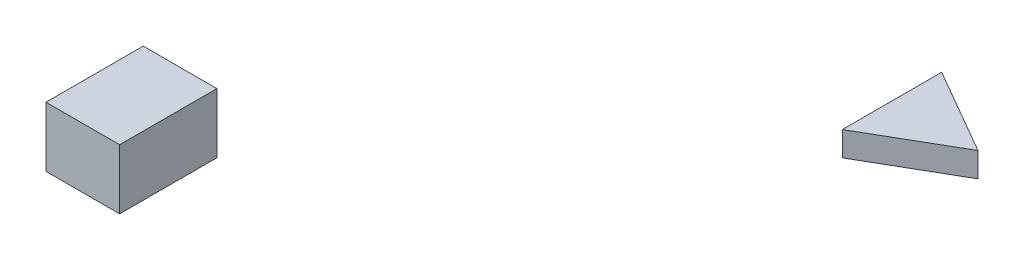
ISO-10303-21;
HEADER;
FILE_DESCRIPTION(('STEP AP214'),'2;1');
FILE_NAME('part.step','',(''),(''),'','','');
FILE_SCHEMA(('AUTOMOTIVE_DESIGN { 1 0 10303 214 1 1 1 1 }'));
ENDSEC;
DATA;
#1=APPLICATION_CONTEXT('core data for automotive mechanical design processes');
#2=APPLICATION_PROTOCOL_DEFINITION('international standard','automotive_design',2000,#1);
#3=PRODUCT_CONTEXT('',#1,'mechanical');
#4=PRODUCT('Part','Part','',(#3));
#5=PRODUCT_RELATED_PRODUCT_CATEGORY('part','',(#4));
#6=PRODUCT_DEFINITION_FORMATION('','',#4);
#7=PRODUCT_DEFINITION_CONTEXT('part definition',#1,'design');
#8=PRODUCT_DEFINITION('design','',#6,#7);
#9=PRODUCT_DEFINITION_SHAPE('','',#8);
#10=(LENGTH_UNIT() NAMED_UNIT(*) SI_UNIT(.MILLI.,.METRE.));
#11=(NAMED_UNIT(*) PLANE_ANGLE_UNIT() SI_UNIT($,.RADIAN.));
#12=(NAMED_UNIT(*) SI_UNIT($,.STERADIAN.) SOLID_ANGLE_UNIT());
#13=UNCERTAINTY_MEASURE_WITH_UNIT(LENGTH_MEASURE(1.E-05),#10,'distance_accuracy_value','');
#14=(GEOMETRIC_REPRESENTATION_CONTEXT(3) GLOBAL_UNCERTAINTY_ASSIGNED_CONTEXT((#13)) GLOBAL_UNIT_ASSIGNED_CONTEXT((#10,
#11,#12)) REPRESENTATION_CONTEXT('',''));
#15=CARTESIAN_POINT('',(0.,0.,0.));
#16=DIRECTION('',(0.,0.,1.));
#17=DIRECTION('',(1.,0.,0.));
#18=AXIS2_PLACEMENT_3D('',#15,#16,#17);
#19=CARTESIAN_POINT('',(38.1,30.1997522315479,456.248267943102));
#20=DIRECTION('',(0.,0.,-1.));
#21=DIRECTION('',(-1.,0.,0.));
#22=AXIS2_PLACEMENT_3D('',#19,#20,#21);
#23=PLANE('',#22);
#24=DIRECTION('',(0.,-1.,0.));
#25=VECTOR('',#24,1.);
#26=CARTESIAN_POINT('',(-38.1,30.1997522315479,456.248267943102));
#27=LINE('',#26,#25);
#28=CARTESIAN_POINT('',(-38.1,30.1997522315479,456.248267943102));
#29=VERTEX_POINT('',#28);
#30=CARTESIAN_POINT('',(-38.1,-31.8067699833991,456.248267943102));
#31=VERTEX_POINT('',#30);
#32=EDGE_CURVE('E85',#29,#31,#27,.T.);
#33=ORIENTED_EDGE('',*,*,#32,.T.);
#34=DIRECTION('',(-1.,0.,0.));
#35=VECTOR('',#34,1.);
#36=CARTESIAN_POINT('',(38.1,-31.8067699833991,456.248267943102));
#37=LINE('',#36,#35);
#38=CARTESIAN_POINT('',(38.1,-31.8067699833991,456.248267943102));
#39=VERTEX_POINT('',#38);
#40=EDGE_CURVE('E12',#39,#31,#37,.T.);
#41=ORIENTED_EDGE('',*,*,#40,.F.);
#42=DIRECTION('',(0.,-1.,0.));
#43=VECTOR('',#42,1.);
#44=CARTESIAN_POINT('',(38.1,30.1997522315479,456.248267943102));
#45=LINE('',#44,#43);
#46=CARTESIAN_POINT('',(38.1,30.1997522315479,456.248267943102));
#47=VERTEX_POINT('',#46);
#48=EDGE_CURVE('E103',#47,#39,#45,.T.);
#49=ORIENTED_EDGE('',*,*,#48,.F.);
#50=DIRECTION('',(-1.,0.,0.));
#51=VECTOR('',#50,1.);
#52=CARTESIAN_POINT('',(38.1,30.1997522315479,456.248267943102));
#53=LINE('',#52,#51);
#54=EDGE_CURVE('E97',#47,#29,#53,.T.);
#55=ORIENTED_EDGE('',*,*,#54,.T.);
#56=EDGE_LOOP('',(#33,#41,#49,#55));
#57=FACE_BOUND('',#56,.T.);
#58=ADVANCED_FACE('F41',(#57),#23,.F.);
#59=CARTESIAN_POINT('',(38.1,-31.8067699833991,456.248267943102));
#60=DIRECTION('',(0.,1.,0.));
#61=DIRECTION('',(0.,0.,1.));
#62=AXIS2_PLACEMENT_3D('',#59,#60,#61);
#63=PLANE('',#62);
#64=DIRECTION('',(0.,0.,-1.));
#65=VECTOR('',#64,1.);
#66=CARTESIAN_POINT('',(-38.1,-31.8067699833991,456.248267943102));
#67=LINE('',#66,#65);
#68=CARTESIAN_POINT('',(-38.1,-31.8067699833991,355.6));
#69=VERTEX_POINT('',#68);
#70=EDGE_CURVE('E81',#31,#69,#67,.T.);
#71=ORIENTED_EDGE('',*,*,#70,.T.);
#72=DIRECTION('',(-1.,0.,0.));
#73=VECTOR('',#72,1.);
#74=CARTESIAN_POINT('',(38.1,-31.8067699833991,355.6));
#75=LINE('',#74,#73);
#76=CARTESIAN_POINT('',(38.1,-31.8067699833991,355.6));
#77=VERTEX_POINT('',#76);
#78=EDGE_CURVE('E48',#77,#69,#75,.T.);
#79=ORIENTED_EDGE('',*,*,#78,.F.);
#80=DIRECTION('',(0.,0.,-1.));
#81=VECTOR('',#80,1.);
#82=CARTESIAN_POINT('',(38.1,-31.8067699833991,456.248267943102));
#83=LINE('',#82,#81);
#84=EDGE_CURVE('E93',#39,#77,#83,.T.);
#85=ORIENTED_EDGE('',*,*,#84,.F.);
#86=ORIENTED_EDGE('',*,*,#40,.T.);
#87=EDGE_LOOP('',(#71,#79,#85,#86));
#88=FACE_BOUND('',#87,.T.);
#89=ADVANCED_FACE('F92',(#88),#63,.F.);
#90=CARTESIAN_POINT('',(38.1,30.1997522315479,355.6));
#91=DIRECTION('',(0.,0.,1.));
#92=DIRECTION('',(1.,0.,0.));
#93=AXIS2_PLACEMENT_3D('',#90,#91,#92);
#94=PLANE('',#93);
#95=DIRECTION('',(0.,1.,0.));
#96=VECTOR('',#95,1.);
#97=CARTESIAN_POINT('',(-38.1,30.1997522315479,355.6));
#98=LINE('',#97,#96);
#99=CARTESIAN_POINT('',(-38.1,30.1997522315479,355.6));
#100=VERTEX_POINT('',#99);
#101=EDGE_CURVE('E86',#69,#100,#98,.T.);
#102=ORIENTED_EDGE('',*,*,#101,.T.);
#103=DIRECTION('',(-1.,0.,0.));
#104=VECTOR('',#103,1.);
#105=CARTESIAN_POINT('',(38.1,30.1997522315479,355.6));
#106=LINE('',#105,#104);
#107=CARTESIAN_POINT('',(38.1,30.1997522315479,355.6));
#108=VERTEX_POINT('',#107);
#109=EDGE_CURVE('E109',#108,#100,#106,.T.);
#110=ORIENTED_EDGE('',*,*,#109,.F.);
#111=DIRECTION('',(0.,1.,0.));
#112=VECTOR('',#111,1.);
#113=CARTESIAN_POINT('',(38.1,30.1997522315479,355.6));
#114=LINE('',#113,#112);
#115=EDGE_CURVE('E60',#77,#108,#114,.T.);
#116=ORIENTED_EDGE('',*,*,#115,.F.);
#117=ORIENTED_EDGE('',*,*,#78,.T.);
#118=EDGE_LOOP('',(#102,#110,#116,#117));
#119=FACE_BOUND('',#118,.T.);
#120=ADVANCED_FACE('F112',(#119),#94,.F.);
#121=CARTESIAN_POINT('',(38.1,30.1997522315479,456.248267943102));
#122=DIRECTION('',(0.,-1.,0.));
#123=DIRECTION('',(0.,0.,-1.));
#124=AXIS2_PLACEMENT_3D('',#121,#122,#123);
#125=PLANE('',#124);
#126=DIRECTION('',(0.,0.,1.));
#127=VECTOR('',#126,1.);
#128=CARTESIAN_POINT('',(-38.1,30.1997522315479,456.248267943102));
#129=LINE('',#128,#127);
#130=EDGE_CURVE('E101',#100,#29,#129,.T.);
#131=ORIENTED_EDGE('',*,*,#130,.T.);
#132=ORIENTED_EDGE('',*,*,#54,.F.);
#133=DIRECTION('',(0.,0.,1.));
#134=VECTOR('',#133,1.);
#135=CARTESIAN_POINT('',(38.1,30.1997522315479,456.248267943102));
#136=LINE('',#135,#134);
#137=EDGE_CURVE('E55',#108,#47,#136,.T.);
#138=ORIENTED_EDGE('',*,*,#137,.F.);
#139=ORIENTED_EDGE('',*,*,#109,.T.);
#140=EDGE_LOOP('',(#131,#132,#138,#139));
#141=FACE_BOUND('',#140,.T.);
#142=ADVANCED_FACE('F114',(#141),#125,.F.);
#143=CARTESIAN_POINT('',(38.1,-31.8067699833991,456.248267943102));
#144=DIRECTION('',(1.,0.,0.));
#145=DIRECTION('',(0.,0.,-1.));
#146=AXIS2_PLACEMENT_3D('',#143,#144,#145);
#147=PLANE('',#146);
#148=ORIENTED_EDGE('',*,*,#48,.T.);
#149=ORIENTED_EDGE('',*,*,#84,.T.);
#150=ORIENTED_EDGE('',*,*,#115,.T.);
#151=ORIENTED_EDGE('',*,*,#137,.T.);
#152=EDGE_LOOP('',(#148,#149,#150,#151));
#153=FACE_BOUND('',#152,.T.);
#154=ADVANCED_FACE('F115',(#153),#147,.T.);
#155=CARTESIAN_POINT('',(-38.1,-31.8067699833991,456.248267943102));
#156=DIRECTION('',(1.,0.,0.));
#157=DIRECTION('',(0.,0.,-1.));
#158=AXIS2_PLACEMENT_3D('',#155,#156,#157);
#159=PLANE('',#158);
#160=ORIENTED_EDGE('',*,*,#32,.F.);
#161=ORIENTED_EDGE('',*,*,#130,.F.);
#162=ORIENTED_EDGE('',*,*,#101,.F.);
#163=ORIENTED_EDGE('',*,*,#70,.F.);
#164=EDGE_LOOP('',(#160,#161,#162,#163));
#165=FACE_BOUND('',#164,.T.);
#166=ADVANCED_FACE('F82',(#165),#159,.F.);
#167=CLOSED_SHELL('',(#58,#89,#120,#142,#154,#166));
#168=MANIFOLD_SOLID_BREP('B2',#167);
#169=CARTESIAN_POINT('',(469.984836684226,12.7,-0.271765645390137));
#170=DIRECTION('',(-0.5,0.,0.866025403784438));
#171=DIRECTION('',(0.866025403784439,0.,0.5));
#172=AXIS2_PLACEMENT_3D('',#169,#170,#171);
#173=PLANE('',#172);
#174=DIRECTION('',(-0.866025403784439,0.,-0.5));
#175=VECTOR('',#174,1.);
#176=CARTESIAN_POINT('',(469.984836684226,-12.7,-0.271765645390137));
#177=LINE('',#176,#175);
#178=CARTESIAN_POINT('',(469.984836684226,-12.7,-0.271765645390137));
#179=VERTEX_POINT('',#178);
#180=CARTESIAN_POINT('',(381.,-12.7,-51.6471850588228));
#181=VERTEX_POINT('',#180);
#182=EDGE_CURVE('E201',#179,#181,#177,.T.);
#183=ORIENTED_EDGE('',*,*,#182,.T.);
#184=DIRECTION('',(0.,-1.,0.));
#185=VECTOR('',#184,1.);
#186=CARTESIAN_POINT('',(381.,12.7,-51.6471850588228));
#187=LINE('',#186,#185);
#188=CARTESIAN_POINT('',(381.,12.7,-51.6471850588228));
#189=VERTEX_POINT('',#188);
#190=EDGE_CURVE('E39',#189,#181,#187,.T.);
#191=ORIENTED_EDGE('',*,*,#190,.F.);
#192=DIRECTION('',(-0.866025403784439,0.,-0.5));
#193=VECTOR('',#192,1.);
#194=CARTESIAN_POINT('',(469.984836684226,12.7,-0.271765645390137));
#195=LINE('',#194,#193);
#196=CARTESIAN_POINT('',(469.984836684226,12.7,-0.271765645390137));
#197=VERTEX_POINT('',#196);
#198=EDGE_CURVE('E215',#197,#189,#195,.T.);
#199=ORIENTED_EDGE('',*,*,#198,.F.);
#200=DIRECTION('',(0.,-1.,0.));
#201=VECTOR('',#200,1.);
#202=CARTESIAN_POINT('',(469.984836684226,12.7,-0.271765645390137));
#203=LINE('',#202,#201);
#204=EDGE_CURVE('E211',#197,#179,#203,.T.);
#205=ORIENTED_EDGE('',*,*,#204,.T.);
#206=EDGE_LOOP('',(#183,#191,#199,#205));
#207=FACE_BOUND('',#206,.T.);
#208=ADVANCED_FACE('F165',(#207),#173,.F.);
#209=CARTESIAN_POINT('',(381.,12.7,-51.6471850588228));
#210=DIRECTION('',(1.,0.,0.));
#211=DIRECTION('',(0.,0.,-1.));
#212=AXIS2_PLACEMENT_3D('',#209,#210,#211);
#213=PLANE('',#212);
#214=DIRECTION('',(0.,0.,1.));
#215=VECTOR('',#214,1.);
#216=CARTESIAN_POINT('',(381.,-12.7,-51.6471850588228));
#217=LINE('',#216,#215);
#218=CARTESIAN_POINT('',(381.,-12.7,51.1036537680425));
#219=VERTEX_POINT('',#218);
#220=EDGE_CURVE('E198',#181,#219,#217,.T.);
#221=ORIENTED_EDGE('',*,*,#220,.T.);
#222=DIRECTION('',(0.,-1.,0.));
#223=VECTOR('',#222,1.);
#224=CARTESIAN_POINT('',(381.,12.7,51.1036537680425));
#225=LINE('',#224,#223);
#226=CARTESIAN_POINT('',(381.,12.7,51.1036537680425));
#227=VERTEX_POINT('',#226);
#228=EDGE_CURVE('E172',#227,#219,#225,.T.);
#229=ORIENTED_EDGE('',*,*,#228,.F.);
#230=DIRECTION('',(0.,0.,1.));
#231=VECTOR('',#230,1.);
#232=CARTESIAN_POINT('',(381.,12.7,-51.6471850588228));
#233=LINE('',#232,#231);
#234=EDGE_CURVE('E183',#189,#227,#233,.T.);
#235=ORIENTED_EDGE('',*,*,#234,.F.);
#236=ORIENTED_EDGE('',*,*,#190,.T.);
#237=EDGE_LOOP('',(#221,#229,#235,#236));
#238=FACE_BOUND('',#237,.T.);
#239=ADVANCED_FACE('F207',(#238),#213,.F.);
#240=CARTESIAN_POINT('',(381.,12.7,51.1036537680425));
#241=DIRECTION('',(-0.5,0.,-0.866025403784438));
#242=DIRECTION('',(-0.866025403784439,0.,0.5));
#243=AXIS2_PLACEMENT_3D('',#240,#241,#242);
#244=PLANE('',#243);
#245=DIRECTION('',(0.866025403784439,0.,-0.5));
#246=VECTOR('',#245,1.);
#247=CARTESIAN_POINT('',(381.,-12.7,51.1036537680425));
#248=LINE('',#247,#246);
#249=EDGE_CURVE('E202',#219,#179,#248,.T.);
#250=ORIENTED_EDGE('',*,*,#249,.T.);
#251=ORIENTED_EDGE('',*,*,#204,.F.);
#252=DIRECTION('',(0.866025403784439,0.,-0.5));
#253=VECTOR('',#252,1.);
#254=CARTESIAN_POINT('',(381.,12.7,51.1036537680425));
#255=LINE('',#254,#253);
#256=EDGE_CURVE('E179',#227,#197,#255,.T.);
#257=ORIENTED_EDGE('',*,*,#256,.F.);
#258=ORIENTED_EDGE('',*,*,#228,.T.);
#259=EDGE_LOOP('',(#250,#251,#257,#258));
#260=FACE_BOUND('',#259,.T.);
#261=ADVANCED_FACE('F220',(#260),#244,.F.);
#262=CARTESIAN_POINT('',(469.984836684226,12.7,-0.271765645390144));
#263=DIRECTION('',(0.,-1.,0.));
#264=DIRECTION('',(0.,0.,-1.));
#265=AXIS2_PLACEMENT_3D('',#262,#263,#264);
#266=PLANE('',#265);
#267=ORIENTED_EDGE('',*,*,#198,.T.);
#268=ORIENTED_EDGE('',*,*,#234,.T.);
#269=ORIENTED_EDGE('',*,*,#256,.T.);
#270=EDGE_LOOP('',(#267,#268,#269));
#271=FACE_BOUND('',#270,.T.);
#272=ADVANCED_FACE('F221',(#271),#266,.F.);
#273=CARTESIAN_POINT('',(469.984836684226,-12.7,-0.271765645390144));
#274=DIRECTION('',(0.,-1.,0.));
#275=DIRECTION('',(0.,0.,-1.));
#276=AXIS2_PLACEMENT_3D('',#273,#274,#275);
#277=PLANE('',#276);
#278=ORIENTED_EDGE('',*,*,#182,.F.);
#279=ORIENTED_EDGE('',*,*,#249,.F.);
#280=ORIENTED_EDGE('',*,*,#220,.F.);
#281=EDGE_LOOP('',(#278,#279,#280));
#282=FACE_BOUND('',#281,.T.);
#283=ADVANCED_FACE('F199',(#282),#277,.T.);
#284=CLOSED_SHELL('',(#208,#239,#261,#272,#283));
#285=MANIFOLD_SOLID_BREP('B6',#284);
#286=ADVANCED_BREP_SHAPE_REPRESENTATION('',(#18,#168,#285),#14);
#287=SHAPE_DEFINITION_REPRESENTATION(#9,#286);
ENDSEC;
END-ISO-10303-21;
